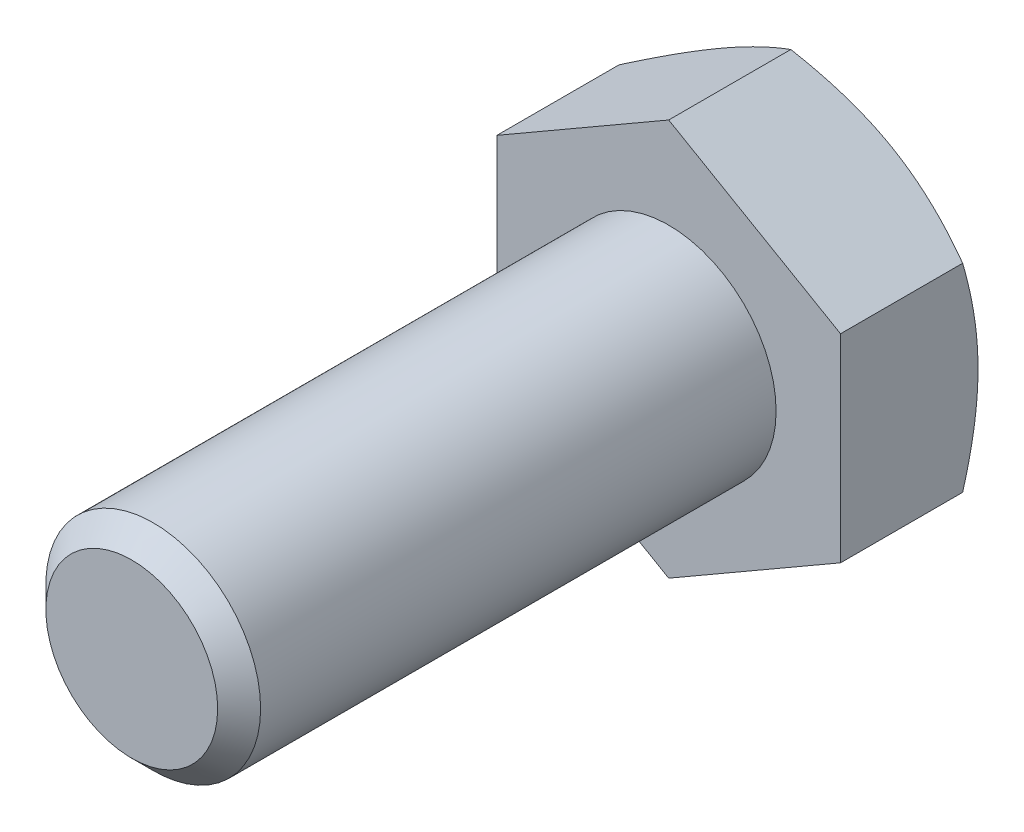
ISO-10303-21;
HEADER;
FILE_DESCRIPTION(('STEP AP214'),'2;1');
FILE_NAME('part.step','',(''),(''),'','','');
FILE_SCHEMA(('AUTOMOTIVE_DESIGN { 1 0 10303 214 1 1 1 1 }'));
ENDSEC;
DATA;
#1=APPLICATION_CONTEXT('core data for automotive mechanical design processes');
#2=APPLICATION_PROTOCOL_DEFINITION('international standard','automotive_design',2000,#1);
#3=PRODUCT_CONTEXT('',#1,'mechanical');
#4=PRODUCT('Part','Part','',(#3));
#5=PRODUCT_RELATED_PRODUCT_CATEGORY('part','',(#4));
#6=PRODUCT_DEFINITION_FORMATION('','',#4);
#7=PRODUCT_DEFINITION_CONTEXT('part definition',#1,'design');
#8=PRODUCT_DEFINITION('design','',#6,#7);
#9=PRODUCT_DEFINITION_SHAPE('','',#8);
#10=(LENGTH_UNIT() NAMED_UNIT(*) SI_UNIT(.MILLI.,.METRE.));
#11=(NAMED_UNIT(*) PLANE_ANGLE_UNIT() SI_UNIT($,.RADIAN.));
#12=(NAMED_UNIT(*) SI_UNIT($,.STERADIAN.) SOLID_ANGLE_UNIT());
#13=UNCERTAINTY_MEASURE_WITH_UNIT(LENGTH_MEASURE(1.E-05),#10,'distance_accuracy_value','');
#14=(GEOMETRIC_REPRESENTATION_CONTEXT(3) GLOBAL_UNCERTAINTY_ASSIGNED_CONTEXT((#13)) GLOBAL_UNIT_ASSIGNED_CONTEXT((#10,
#11,#12)) REPRESENTATION_CONTEXT('',''));
#15=CARTESIAN_POINT('',(0.,0.,0.));
#16=DIRECTION('',(0.,0.,1.));
#17=DIRECTION('',(1.,0.,0.));
#18=AXIS2_PLACEMENT_3D('',#15,#16,#17);
#19=CARTESIAN_POINT('',(0.,0.,25.));
#20=DIRECTION('',(0.,0.,1.));
#21=DIRECTION('',(1.,0.,0.));
#22=AXIS2_PLACEMENT_3D('',#19,#20,#21);
#23=PLANE('',#22);
#24=CARTESIAN_POINT('',(0.,0.,25.));
#25=DIRECTION('',(0.,0.,1.));
#26=DIRECTION('',(1.,0.,0.));
#27=AXIS2_PLACEMENT_3D('',#24,#25,#26);
#28=CIRCLE('',#27,4.);
#29=CARTESIAN_POINT('',(4.00000000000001,0.,25.));
#30=VERTEX_POINT('',#29);
#31=EDGE_CURVE('E205',#30,#30,#28,.T.);
#32=ORIENTED_EDGE('',*,*,#31,.T.);
#33=EDGE_LOOP('',(#32));
#34=FACE_BOUND('',#33,.T.);
#35=ADVANCED_FACE('F31',(#34),#23,.T.);
#36=CARTESIAN_POINT('',(0.,0.,0.));
#37=DIRECTION('',(0.,0.,1.));
#38=DIRECTION('',(1.,0.,0.));
#39=AXIS2_PLACEMENT_3D('',#36,#37,#38);
#40=CYLINDRICAL_SURFACE('',#39,5.);
#41=CARTESIAN_POINT('',(0.,0.,24.));
#42=DIRECTION('',(0.,0.,1.));
#43=DIRECTION('',(1.,0.,0.));
#44=AXIS2_PLACEMENT_3D('',#41,#42,#43);
#45=CIRCLE('',#44,5.);
#46=CARTESIAN_POINT('',(5.,0.,24.));
#47=VERTEX_POINT('',#46);
#48=EDGE_CURVE('E207',#47,#47,#45,.F.);
#49=ORIENTED_EDGE('',*,*,#48,.T.);
#50=EDGE_LOOP('',(#49));
#51=FACE_BOUND('',#50,.T.);
#52=CARTESIAN_POINT('',(0.,0.,0.));
#53=DIRECTION('',(0.,0.,1.));
#54=DIRECTION('',(1.,0.,0.));
#55=AXIS2_PLACEMENT_3D('',#52,#53,#54);
#56=CIRCLE('',#55,5.);
#57=CARTESIAN_POINT('',(5.,0.,0.));
#58=VERTEX_POINT('',#57);
#59=EDGE_CURVE('E208',#58,#58,#56,.F.);
#60=ORIENTED_EDGE('',*,*,#59,.F.);
#61=EDGE_LOOP('',(#60));
#62=FACE_BOUND('',#61,.T.);
#63=ADVANCED_FACE('F196',(#51,#62),#40,.T.);
#64=CARTESIAN_POINT('',(0.,0.,25.));
#65=DIRECTION('',(0.,0.,-1.));
#66=DIRECTION('',(-1.,0.,0.));
#67=AXIS2_PLACEMENT_3D('',#64,#65,#66);
#68=CONICAL_SURFACE('',#67,4.,0.785398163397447);
#69=ORIENTED_EDGE('',*,*,#48,.F.);
#70=EDGE_LOOP('',(#69));
#71=FACE_BOUND('',#70,.T.);
#72=ORIENTED_EDGE('',*,*,#31,.F.);
#73=EDGE_LOOP('',(#72));
#74=FACE_BOUND('',#73,.T.);
#75=ADVANCED_FACE('F201',(#71,#74),#68,.T.);
#76=CARTESIAN_POINT('',(0.,9.23760430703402,-6.4));
#77=DIRECTION('',(0.499999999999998,0.86602540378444,0.));
#78=DIRECTION('',(-0.86602540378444,0.499999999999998,0.));
#79=AXIS2_PLACEMENT_3D('',#76,#77,#78);
#80=PLANE('',#79);
#81=CARTESIAN_POINT('',(-0.000200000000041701,9.23771977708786,-5.68540215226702));
#82=CARTESIAN_POINT('',(0.175648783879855,9.13619343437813,-5.74400928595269));
#83=CARTESIAN_POINT('',(0.352153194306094,9.03428856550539,-5.7999565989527));
#84=CARTESIAN_POINT('',(0.70659546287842,8.82965122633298,-5.90579899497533));
#85=CARTESIAN_POINT('',(0.884533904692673,8.72691841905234,-5.95569146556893));
#86=CARTESIAN_POINT('',(1.42119823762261,8.41707512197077,-6.09530720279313));
#87=CARTESIAN_POINT('',(1.78204258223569,8.20874154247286,-6.17471882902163));
#88=CARTESIAN_POINT('',(2.32203917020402,7.89697436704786,-6.26783835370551));
#89=CARTESIAN_POINT('',(2.49957818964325,7.79447216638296,-6.29436541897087));
#90=CARTESIAN_POINT('',(2.85545911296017,7.58900421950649,-6.33884682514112));
#91=CARTESIAN_POINT('',(3.03380094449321,7.48603851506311,-6.35680192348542));
#92=CARTESIAN_POINT('',(3.39079168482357,7.27992981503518,-6.38368435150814));
#93=CARTESIAN_POINT('',(3.56944001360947,7.17678715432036,-6.39262192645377));
#94=CARTESIAN_POINT('',(3.92690170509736,6.97040655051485,-6.40127769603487));
#95=CARTESIAN_POINT('',(4.10571506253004,6.86716861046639,-6.40099617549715));
#96=CARTESIAN_POINT('',(4.44001336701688,6.67416139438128,-6.39185497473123));
#97=CARTESIAN_POINT('',(4.59552190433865,6.58437849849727,-6.38411039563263));
#98=CARTESIAN_POINT('',(4.90617476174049,6.4050229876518,-6.36179886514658));
#99=CARTESIAN_POINT('',(5.06131905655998,6.31545038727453,-6.34723145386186));
#100=CARTESIAN_POINT('',(5.5261513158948,6.04707935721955,-6.29363930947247));
#101=CARTESIAN_POINT('',(5.83501648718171,5.86875596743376,-6.24473135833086));
#102=CARTESIAN_POINT('',(6.45602322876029,5.51021755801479,-6.12246059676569));
#103=CARTESIAN_POINT('',(6.76808554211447,5.33004829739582,-6.048579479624));
#104=CARTESIAN_POINT('',(7.38755648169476,4.97239658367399,-5.88089985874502));
#105=CARTESIAN_POINT('',(7.69497304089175,4.79490955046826,-5.78714073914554));
#106=CARTESIAN_POINT('',(8.0002,4.61868668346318,-5.68540215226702));
#107=B_SPLINE_CURVE_WITH_KNOTS('',3,(#81,#82,#83,#84,#85,#86,#87,#88,#89,#90,#91,#92,#93,#94,
#95,#96,#97,#98,#99,#100,#101,#102,#103,#104,#105,#106),.UNSPECIFIED.,.F.,.F.,(4,2,2,2,2,2,2,2,
2,2,2,2,4),(0.,0.633973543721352,1.26821965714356,2.53934712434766,3.1593434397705,
3.77928496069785,4.39852133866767,5.01773858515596,5.5568023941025,6.0959025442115,
7.17487077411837,8.27776850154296,9.37850115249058),.UNSPECIFIED.);
#108=CARTESIAN_POINT('',(0.,9.23760430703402,-5.68546882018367));
#109=VERTEX_POINT('',#108);
#110=CARTESIAN_POINT('',(3.99999999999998,6.92820323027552,-6.4));
#111=VERTEX_POINT('',#110);
#112=EDGE_CURVE('E241',#109,#111,#107,.T.);
#113=ORIENTED_EDGE('',*,*,#112,.F.);
#114=DIRECTION('',(0.,0.,1.));
#115=VECTOR('',#114,1.);
#116=CARTESIAN_POINT('',(0.,9.23760430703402,-6.4));
#117=LINE('',#116,#115);
#118=CARTESIAN_POINT('',(0.,9.23760430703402,0.));
#119=VERTEX_POINT('',#118);
#120=EDGE_CURVE('E215',#109,#119,#117,.T.);
#121=ORIENTED_EDGE('',*,*,#120,.T.);
#122=DIRECTION('',(-0.86602540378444,0.499999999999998,0.));
#123=VECTOR('',#122,1.);
#124=CARTESIAN_POINT('',(0.,9.23760430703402,0.));
#125=LINE('',#124,#123);
#126=CARTESIAN_POINT('',(8.,4.61880215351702,0.));
#127=VERTEX_POINT('',#126);
#128=EDGE_CURVE('E239',#127,#119,#125,.T.);
#129=ORIENTED_EDGE('',*,*,#128,.F.);
#130=DIRECTION('',(0.,0.,1.));
#131=VECTOR('',#130,1.);
#132=CARTESIAN_POINT('',(8.,4.61880215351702,-6.4));
#133=LINE('',#132,#131);
#134=CARTESIAN_POINT('',(8.,4.61880215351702,-5.68546882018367));
#135=VERTEX_POINT('',#134);
#136=EDGE_CURVE('E212',#135,#127,#133,.T.);
#137=ORIENTED_EDGE('',*,*,#136,.F.);
#138=EDGE_CURVE('E171',#111,#135,#107,.T.);
#139=ORIENTED_EDGE('',*,*,#138,.F.);
#140=EDGE_LOOP('',(#113,#121,#129,#137,#139));
#141=FACE_BOUND('',#140,.T.);
#142=ADVANCED_FACE('F181',(#141),#80,.T.);
#143=CARTESIAN_POINT('',(8.,-4.61880215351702,-6.4));
#144=DIRECTION('',(1.,0.,0.));
#145=DIRECTION('',(0.,0.,-1.));
#146=AXIS2_PLACEMENT_3D('',#143,#144,#145);
#147=PLANE('',#146);
#148=CARTESIAN_POINT('',(8.,-12.5978512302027,-2.40281206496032));
#149=CARTESIAN_POINT('',(8.,-12.246746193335,-2.57388946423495));
#150=CARTESIAN_POINT('',(8.,-11.8948553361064,-2.74338074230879));
#151=CARTESIAN_POINT('',(8.,-11.1890846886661,-3.07830251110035));
#152=CARTESIAN_POINT('',(8.,-10.835204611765,-3.24373239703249));
#153=CARTESIAN_POINT('',(8.,-10.1233054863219,-3.57043443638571));
#154=CARTESIAN_POINT('',(8.,-9.76527449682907,-3.73168065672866));
#155=CARTESIAN_POINT('',(8.,-9.04643054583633,-4.04782365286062));
#156=CARTESIAN_POINT('',(8.,-8.68561771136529,-4.20272071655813));
#157=CARTESIAN_POINT('',(8.,-7.94836823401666,-4.50960168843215));
#158=CARTESIAN_POINT('',(8.,-7.57181608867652,-4.66130959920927));
#159=CARTESIAN_POINT('',(8.,-6.81437869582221,-4.95369969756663));
#160=CARTESIAN_POINT('',(8.,-6.43349297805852,-5.09438067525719));
#161=CARTESIAN_POINT('',(8.,-5.66743059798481,-5.36116349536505));
#162=CARTESIAN_POINT('',(8.,-5.28226375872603,-5.48729325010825));
#163=CARTESIAN_POINT('',(8.,-4.50642197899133,-5.72105487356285));
#164=CARTESIAN_POINT('',(8.,-4.11574875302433,-5.82869236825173));
#165=CARTESIAN_POINT('',(8.,-3.33076858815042,-6.01985550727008));
#166=CARTESIAN_POINT('',(8.,-2.9364953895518,-6.10351603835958));
#167=CARTESIAN_POINT('',(8.,-2.34134760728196,-6.20749259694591));
#168=CARTESIAN_POINT('',(8.,-2.1423290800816,-6.23856705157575));
#169=CARTESIAN_POINT('',(8.,-1.7432391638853,-6.29294025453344));
#170=CARTESIAN_POINT('',(8.,-1.54316787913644,-6.31623975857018));
#171=CARTESIAN_POINT('',(8.,-1.14493807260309,-6.35429623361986));
#172=CARTESIAN_POINT('',(8.,-0.94679021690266,-6.36916434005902));
#173=CARTESIAN_POINT('',(8.,-0.550042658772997,-6.39050002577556));
#174=CARTESIAN_POINT('',(8.,-0.351442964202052,-6.39696775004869));
#175=CARTESIAN_POINT('',(8.,0.0458536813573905,-6.40134753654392));
#176=CARTESIAN_POINT('',(8.,0.244550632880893,-6.39925955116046));
#177=CARTESIAN_POINT('',(8.,0.641675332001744,-6.38658102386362));
#178=CARTESIAN_POINT('',(8.,0.840103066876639,-6.37599009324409));
#179=CARTESIAN_POINT('',(8.,1.31123186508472,-6.3409781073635));
#180=CARTESIAN_POINT('',(8.,1.58366327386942,-6.31284309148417));
#181=CARTESIAN_POINT('',(8.,2.12661564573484,-6.24203710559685));
#182=CARTESIAN_POINT('',(8.,2.39713636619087,-6.19936432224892));
#183=CARTESIAN_POINT('',(8.,3.20545284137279,-6.0517930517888));
#184=CARTESIAN_POINT('',(8.,3.73973646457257,-5.9273641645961));
#185=CARTESIAN_POINT('',(8.,4.53906436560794,-5.71012995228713));
#186=CARTESIAN_POINT('',(8.,4.80821183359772,-5.63154182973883));
#187=CARTESIAN_POINT('',(8.,5.34389592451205,-5.46584170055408));
#188=CARTESIAN_POINT('',(8.,5.61043252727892,-5.37872962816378));
#189=CARTESIAN_POINT('',(8.,6.14097486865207,-5.1974091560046));
#190=CARTESIAN_POINT('',(8.,6.40498129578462,-5.10320275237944));
#191=CARTESIAN_POINT('',(8.,6.93077992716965,-4.90883812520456));
#192=CARTESIAN_POINT('',(8.,7.19257218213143,-4.8086800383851));
#193=CARTESIAN_POINT('',(8.,7.89757234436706,-4.53123135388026));
#194=CARTESIAN_POINT('',(8.,8.33892089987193,-4.34922056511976));
#195=CARTESIAN_POINT('',(8.,9.21706508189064,-3.97449001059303));
#196=CARTESIAN_POINT('',(8.,9.6538601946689,-3.78176905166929));
#197=CARTESIAN_POINT('',(8.,10.5239434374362,-3.38815487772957));
#198=CARTESIAN_POINT('',(8.,10.9572301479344,-3.18725853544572));
#199=CARTESIAN_POINT('',(8.,11.8208356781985,-2.77925077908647));
#200=CARTESIAN_POINT('',(8.,12.251154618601,-2.57213961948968));
#201=CARTESIAN_POINT('',(8.,13.1101061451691,-2.15271844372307));
#202=CARTESIAN_POINT('',(8.,13.5387348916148,-1.94040058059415));
#203=CARTESIAN_POINT('',(8.,14.3940561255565,-1.51189757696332));
#204=CARTESIAN_POINT('',(8.,14.8207485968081,-1.29571240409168));
#205=CARTESIAN_POINT('',(8.,15.672448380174,-0.860283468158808));
#206=CARTESIAN_POINT('',(8.,16.0974560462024,-0.641040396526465));
#207=CARTESIAN_POINT('',(8.,16.9461557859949,-0.200021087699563));
#208=CARTESIAN_POINT('',(8.,17.3698478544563,0.0217551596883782));
#209=CARTESIAN_POINT('',(8.,18.5495919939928,0.64296873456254));
#210=CARTESIAN_POINT('',(8.,19.3044430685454,1.04468640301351));
#211=CARTESIAN_POINT('',(8.,20.8116128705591,1.85294502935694));
#212=CARTESIAN_POINT('',(8.,21.5639314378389,2.25948628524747));
#213=CARTESIAN_POINT('',(8.,23.0640825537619,3.074790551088));
#214=CARTESIAN_POINT('',(8.,23.8119216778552,3.48354147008));
#215=CARTESIAN_POINT('',(8.,24.9325210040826,4.09870759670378));
#216=CARTESIAN_POINT('',(8.,25.3058462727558,4.30409483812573));
#217=CARTESIAN_POINT('',(8.,26.0521604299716,4.71547851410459));
#218=CARTESIAN_POINT('',(8.,26.4251493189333,4.92147494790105));
#219=CARTESIAN_POINT('',(8.,26.7979906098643,5.12773824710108));
#220=B_SPLINE_CURVE_WITH_KNOTS('',3,(#148,#149,#150,#151,#152,#153,#154,#155,#156,#157,#158,
#159,#160,#161,#162,#163,#164,#165,#166,#167,#168,#169,#170,#171,#172,#173,#174,#175,#176,#177,
#178,#179,#180,#181,#182,#183,#184,#185,#186,#187,#188,#189,#190,#191,#192,#193,#194,#195,#196,
#197,#198,#199,#200,#201,#202,#203,#204,#205,#206,#207,#208,#209,#210,#211,#212,#213,#214,#215,
#216,#217,#218,#219),.UNSPECIFIED.,.F.,.F.,(4,2,2,2,2,2,2,2,2,2,2,2,2,2,2,2,2,2,2,2,2,2,2,2,2,2,
2,2,2,2,2,2,2,2,2,4),(0.,1.17171303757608,2.34359951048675,3.52154779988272,4.69944261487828,
5.91720060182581,7.13509201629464,8.35060698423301,9.56575149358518,10.7739194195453,
11.3780811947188,11.982184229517,12.5781274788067,13.1740604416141,13.7699967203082,
14.3659602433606,15.1871414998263,16.0084252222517,17.651791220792,18.4928743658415,
19.3339639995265,20.1748178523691,21.0156523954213,22.4476587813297,23.8798250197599,
25.312544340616,26.7452050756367,28.1801767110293,29.6151603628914,31.0498246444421,
32.48449470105,35.0497345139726,37.6151336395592,40.1718943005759,41.4501744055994,
42.7284529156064),.UNSPECIFIED.);
#221=CARTESIAN_POINT('',(8.,0.,-6.4));
#222=VERTEX_POINT('',#221);
#223=EDGE_CURVE('E169',#135,#222,#220,.F.);
#224=ORIENTED_EDGE('',*,*,#223,.F.);
#225=ORIENTED_EDGE('',*,*,#136,.T.);
#226=DIRECTION('',(0.,1.,0.));
#227=VECTOR('',#226,1.);
#228=CARTESIAN_POINT('',(8.,-4.61880215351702,0.));
#229=LINE('',#228,#227);
#230=CARTESIAN_POINT('',(8.,-4.61880215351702,0.));
#231=VERTEX_POINT('',#230);
#232=EDGE_CURVE('E217',#231,#127,#229,.T.);
#233=ORIENTED_EDGE('',*,*,#232,.F.);
#234=DIRECTION('',(0.,0.,1.));
#235=VECTOR('',#234,1.);
#236=CARTESIAN_POINT('',(8.,-4.61880215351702,-6.4));
#237=LINE('',#236,#235);
#238=CARTESIAN_POINT('',(8.,-4.61880215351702,-5.68546882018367));
#239=VERTEX_POINT('',#238);
#240=EDGE_CURVE('E223',#239,#231,#237,.T.);
#241=ORIENTED_EDGE('',*,*,#240,.F.);
#242=EDGE_CURVE('E164',#222,#239,#220,.F.);
#243=ORIENTED_EDGE('',*,*,#242,.F.);
#244=EDGE_LOOP('',(#224,#225,#233,#241,#243));
#245=FACE_BOUND('',#244,.T.);
#246=ADVANCED_FACE('F177',(#245),#147,.T.);
#247=CARTESIAN_POINT('',(0.,-9.23760430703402,-6.4));
#248=DIRECTION('',(0.499999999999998,-0.86602540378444,0.));
#249=DIRECTION('',(0.86602540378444,0.499999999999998,0.));
#250=AXIS2_PLACEMENT_3D('',#247,#248,#249);
#251=PLANE('',#250);
#252=CARTESIAN_POINT('',(8.0002,-4.61868668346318,-5.68540215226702));
#253=CARTESIAN_POINT('',(7.8243512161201,-4.72021302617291,-5.74400928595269));
#254=CARTESIAN_POINT('',(7.64784680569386,-4.82211789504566,-5.7999565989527));
#255=CARTESIAN_POINT('',(7.29340453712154,-5.02675523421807,-5.90579899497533));
#256=CARTESIAN_POINT('',(7.11546609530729,-5.12948804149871,-5.95569146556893));
#257=CARTESIAN_POINT('',(6.57880176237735,-5.43933133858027,-6.09530720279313));
#258=CARTESIAN_POINT('',(6.21795741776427,-5.64766491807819,-6.17471882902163));
#259=CARTESIAN_POINT('',(5.67796082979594,-5.95943209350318,-6.26783835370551));
#260=CARTESIAN_POINT('',(5.50042181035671,-6.06193429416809,-6.29436541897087));
#261=CARTESIAN_POINT('',(5.14454088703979,-6.26740224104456,-6.33884682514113));
#262=CARTESIAN_POINT('',(4.96619905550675,-6.37036794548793,-6.35680192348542));
#263=CARTESIAN_POINT('',(4.60920831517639,-6.57647664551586,-6.38368435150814));
#264=CARTESIAN_POINT('',(4.43055998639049,-6.67961930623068,-6.39262192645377));
#265=CARTESIAN_POINT('',(4.0730982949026,-6.88599991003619,-6.40127769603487));
#266=CARTESIAN_POINT('',(3.89428493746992,-6.98923785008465,-6.40099617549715));
#267=CARTESIAN_POINT('',(3.55998663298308,-7.18224506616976,-6.39185497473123));
#268=CARTESIAN_POINT('',(3.40447809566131,-7.27202796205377,-6.38411039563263));
#269=CARTESIAN_POINT('',(3.09382523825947,-7.45138347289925,-6.36179886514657));
#270=CARTESIAN_POINT('',(2.93868094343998,-7.54095607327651,-6.34723145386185));
#271=CARTESIAN_POINT('',(2.47384868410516,-7.80932710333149,-6.29363930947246));
#272=CARTESIAN_POINT('',(2.16498351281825,-7.98765049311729,-6.24473135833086));
#273=CARTESIAN_POINT('',(1.54397677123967,-8.34618890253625,-6.12246059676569));
#274=CARTESIAN_POINT('',(1.23191445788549,-8.52635816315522,-6.048579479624));
#275=CARTESIAN_POINT('',(0.612443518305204,-8.88400987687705,-5.88089985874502));
#276=CARTESIAN_POINT('',(0.30502695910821,-9.06149691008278,-5.78714073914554));
#277=CARTESIAN_POINT('',(-0.000200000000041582,-9.23771977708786,-5.68540215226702));
#278=B_SPLINE_CURVE_WITH_KNOTS('',3,(#252,#253,#254,#255,#256,#257,#258,#259,#260,#261,#262,
#263,#264,#265,#266,#267,#268,#269,#270,#271,#272,#273,#274,#275,#276,#277),.UNSPECIFIED.,.F.,
.F.,(4,2,2,2,2,2,2,2,2,2,2,2,4),(0.,0.633973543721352,1.26821965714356,2.53934712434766,
3.1593434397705,3.77928496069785,4.39852133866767,5.01773858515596,5.5568023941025,
6.09590254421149,7.17487077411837,8.27776850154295,9.37850115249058),.UNSPECIFIED.);
#279=CARTESIAN_POINT('',(3.99999999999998,-6.92820323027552,-6.4));
#280=VERTEX_POINT('',#279);
#281=EDGE_CURVE('E170',#239,#280,#278,.T.);
#282=ORIENTED_EDGE('',*,*,#281,.F.);
#283=ORIENTED_EDGE('',*,*,#240,.T.);
#284=DIRECTION('',(0.86602540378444,0.499999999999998,0.));
#285=VECTOR('',#284,1.);
#286=CARTESIAN_POINT('',(0.,-9.23760430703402,0.));
#287=LINE('',#286,#285);
#288=CARTESIAN_POINT('',(0.,-9.23760430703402,0.));
#289=VERTEX_POINT('',#288);
#290=EDGE_CURVE('E228',#289,#231,#287,.T.);
#291=ORIENTED_EDGE('',*,*,#290,.F.);
#292=DIRECTION('',(0.,0.,1.));
#293=VECTOR('',#292,1.);
#294=CARTESIAN_POINT('',(0.,-9.23760430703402,-6.4));
#295=LINE('',#294,#293);
#296=CARTESIAN_POINT('',(0.,-9.23760430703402,-5.68546882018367));
#297=VERTEX_POINT('',#296);
#298=EDGE_CURVE('E221',#297,#289,#295,.T.);
#299=ORIENTED_EDGE('',*,*,#298,.F.);
#300=EDGE_CURVE('E158',#280,#297,#278,.T.);
#301=ORIENTED_EDGE('',*,*,#300,.F.);
#302=EDGE_LOOP('',(#282,#283,#291,#299,#301));
#303=FACE_BOUND('',#302,.T.);
#304=ADVANCED_FACE('F180',(#303),#251,.T.);
#305=CARTESIAN_POINT('',(0.,-9.23760430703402,-6.4));
#306=DIRECTION('',(-0.500000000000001,-0.866025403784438,0.));
#307=DIRECTION('',(0.866025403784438,-0.500000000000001,0.));
#308=AXIS2_PLACEMENT_3D('',#305,#306,#307);
#309=PLANE('',#308);
#310=CARTESIAN_POINT('',(0.000199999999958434,-9.23771977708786,-5.68540215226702));
#311=CARTESIAN_POINT('',(-0.175648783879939,-9.13619343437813,-5.74400928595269));
#312=CARTESIAN_POINT('',(-0.352153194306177,-9.03428856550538,-5.7999565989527));
#313=CARTESIAN_POINT('',(-0.706595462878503,-8.82965122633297,-5.90579899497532));
#314=CARTESIAN_POINT('',(-0.884533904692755,-8.72691841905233,-5.95569146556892));
#315=CARTESIAN_POINT('',(-1.42119823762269,-8.41707512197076,-6.09530720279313));
#316=CARTESIAN_POINT('',(-1.78204258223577,-8.20874154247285,-6.17471882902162));
#317=CARTESIAN_POINT('',(-2.3220391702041,-7.89697436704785,-6.2678383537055));
#318=CARTESIAN_POINT('',(-2.49957818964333,-7.79447216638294,-6.29436541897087));
#319=CARTESIAN_POINT('',(-2.85545911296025,-7.58900421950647,-6.33884682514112));
#320=CARTESIAN_POINT('',(-3.03380094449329,-7.4860385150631,-6.35680192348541));
#321=CARTESIAN_POINT('',(-3.39079168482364,-7.27992981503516,-6.38368435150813));
#322=CARTESIAN_POINT('',(-3.56944001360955,-7.17678715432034,-6.39262192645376));
#323=CARTESIAN_POINT('',(-3.92690170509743,-6.97040655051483,-6.40127769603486));
#324=CARTESIAN_POINT('',(-4.10571506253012,-6.86716861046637,-6.40099617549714));
#325=CARTESIAN_POINT('',(-4.44001336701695,-6.67416139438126,-6.39185497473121));
#326=CARTESIAN_POINT('',(-4.59552190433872,-6.58437849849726,-6.38411039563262));
#327=CARTESIAN_POINT('',(-4.90617476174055,-6.40502298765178,-6.36179886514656));
#328=CARTESIAN_POINT('',(-5.06131905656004,-6.31545038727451,-6.34723145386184));
#329=CARTESIAN_POINT('',(-5.52615131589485,-6.04707935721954,-6.29363930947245));
#330=CARTESIAN_POINT('',(-5.83501648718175,-5.86875596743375,-6.24473135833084));
#331=CARTESIAN_POINT('',(-6.45602322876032,-5.51021755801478,-6.12246059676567));
#332=CARTESIAN_POINT('',(-6.7680855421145,-5.33004829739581,-6.04857947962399));
#333=CARTESIAN_POINT('',(-7.38755648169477,-4.97239658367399,-5.88089985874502));
#334=CARTESIAN_POINT('',(-7.69497304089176,-4.79490955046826,-5.78714073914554));
#335=CARTESIAN_POINT('',(-8.0002,-4.61868668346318,-5.68540215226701));
#336=B_SPLINE_CURVE_WITH_KNOTS('',3,(#310,#311,#312,#313,#314,#315,#316,#317,#318,#319,#320,
#321,#322,#323,#324,#325,#326,#327,#328,#329,#330,#331,#332,#333,#334,#335),.UNSPECIFIED.,.F.,
.F.,(4,2,2,2,2,2,2,2,2,2,2,2,4),(0.,0.633973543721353,1.26821965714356,2.53934712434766,
3.1593434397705,3.77928496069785,4.39852133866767,5.01773858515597,5.55680239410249,
6.09590254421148,7.17487077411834,8.2777685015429,9.37850115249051),.UNSPECIFIED.);
#337=CARTESIAN_POINT('',(-4.00000000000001,-6.9282032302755,-6.4));
#338=VERTEX_POINT('',#337);
#339=EDGE_CURVE('E260',#297,#338,#336,.T.);
#340=ORIENTED_EDGE('',*,*,#339,.F.);
#341=ORIENTED_EDGE('',*,*,#298,.T.);
#342=DIRECTION('',(0.866025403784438,-0.500000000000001,0.));
#343=VECTOR('',#342,1.);
#344=CARTESIAN_POINT('',(0.,-9.23760430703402,0.));
#345=LINE('',#344,#343);
#346=CARTESIAN_POINT('',(-8.,-4.61880215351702,0.));
#347=VERTEX_POINT('',#346);
#348=EDGE_CURVE('E231',#347,#289,#345,.T.);
#349=ORIENTED_EDGE('',*,*,#348,.F.);
#350=DIRECTION('',(0.,0.,1.));
#351=VECTOR('',#350,1.);
#352=CARTESIAN_POINT('',(-8.,-4.61880215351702,-6.4));
#353=LINE('',#352,#351);
#354=CARTESIAN_POINT('',(-8.,-4.61880215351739,-5.68546882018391));
#355=VERTEX_POINT('',#354);
#356=EDGE_CURVE('E219',#355,#347,#353,.T.);
#357=ORIENTED_EDGE('',*,*,#356,.F.);
#358=EDGE_CURVE('E107',#338,#355,#336,.T.);
#359=ORIENTED_EDGE('',*,*,#358,.F.);
#360=EDGE_LOOP('',(#340,#341,#349,#357,#359));
#361=FACE_BOUND('',#360,.T.);
#362=ADVANCED_FACE('F185',(#361),#309,.T.);
#363=CARTESIAN_POINT('',(-8.,-4.61880215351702,-6.4));
#364=DIRECTION('',(-1.,0.,0.));
#365=DIRECTION('',(0.,0.,1.));
#366=AXIS2_PLACEMENT_3D('',#363,#364,#365);
#367=PLANE('',#366);
#368=CARTESIAN_POINT('',(-8.,-12.5978512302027,-2.40281206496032));
#369=CARTESIAN_POINT('',(-8.,-12.246746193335,-2.57388946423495));
#370=CARTESIAN_POINT('',(-8.,-11.8948553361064,-2.74338074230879));
#371=CARTESIAN_POINT('',(-8.,-11.1890846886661,-3.07830251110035));
#372=CARTESIAN_POINT('',(-8.,-10.835204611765,-3.24373239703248));
#373=CARTESIAN_POINT('',(-8.,-10.1233054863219,-3.57043443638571));
#374=CARTESIAN_POINT('',(-8.,-9.76527449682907,-3.73168065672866));
#375=CARTESIAN_POINT('',(-8.,-9.04643054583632,-4.04782365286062));
#376=CARTESIAN_POINT('',(-8.,-8.68561771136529,-4.20272071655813));
#377=CARTESIAN_POINT('',(-8.,-7.94836823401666,-4.50960168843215));
#378=CARTESIAN_POINT('',(-8.,-7.57181608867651,-4.66130959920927));
#379=CARTESIAN_POINT('',(-8.,-6.8143786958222,-4.95369969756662));
#380=CARTESIAN_POINT('',(-8.,-6.43349297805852,-5.09438067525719));
#381=CARTESIAN_POINT('',(-8.,-5.66743059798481,-5.36116349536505));
#382=CARTESIAN_POINT('',(-8.,-5.28226375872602,-5.48729325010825));
#383=CARTESIAN_POINT('',(-8.,-4.50642197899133,-5.72105487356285));
#384=CARTESIAN_POINT('',(-8.,-4.11574875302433,-5.82869236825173));
#385=CARTESIAN_POINT('',(-8.,-3.33076858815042,-6.01985550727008));
#386=CARTESIAN_POINT('',(-8.,-2.9364953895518,-6.10351603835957));
#387=CARTESIAN_POINT('',(-8.,-2.34134760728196,-6.20749259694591));
#388=CARTESIAN_POINT('',(-8.,-2.1423290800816,-6.23856705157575));
#389=CARTESIAN_POINT('',(-8.,-1.7432391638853,-6.29294025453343));
#390=CARTESIAN_POINT('',(-8.,-1.54316787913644,-6.31623975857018));
#391=CARTESIAN_POINT('',(-8.,-1.14493807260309,-6.35429623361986));
#392=CARTESIAN_POINT('',(-8.,-0.946790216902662,-6.36916434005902));
#393=CARTESIAN_POINT('',(-8.,-0.550042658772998,-6.39050002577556));
#394=CARTESIAN_POINT('',(-8.,-0.351442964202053,-6.39696775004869));
#395=CARTESIAN_POINT('',(-8.,0.0458536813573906,-6.40134753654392));
#396=CARTESIAN_POINT('',(-8.,0.244550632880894,-6.39925955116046));
#397=CARTESIAN_POINT('',(-8.,0.641675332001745,-6.38658102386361));
#398=CARTESIAN_POINT('',(-8.,0.84010306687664,-6.37599009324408));
#399=CARTESIAN_POINT('',(-8.,1.31123186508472,-6.3409781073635));
#400=CARTESIAN_POINT('',(-8.,1.58366327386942,-6.31284309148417));
#401=CARTESIAN_POINT('',(-8.,2.12661564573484,-6.24203710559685));
#402=CARTESIAN_POINT('',(-8.,2.39713636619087,-6.19936432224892));
#403=CARTESIAN_POINT('',(-8.,3.20545284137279,-6.0517930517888));
#404=CARTESIAN_POINT('',(-8.,3.73973646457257,-5.92736416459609));
#405=CARTESIAN_POINT('',(-8.,4.53906436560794,-5.71012995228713));
#406=CARTESIAN_POINT('',(-8.,4.80821183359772,-5.63154182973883));
#407=CARTESIAN_POINT('',(-8.,5.34389592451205,-5.46584170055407));
#408=CARTESIAN_POINT('',(-8.,5.61043252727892,-5.37872962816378));
#409=CARTESIAN_POINT('',(-8.,6.14097486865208,-5.1974091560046));
#410=CARTESIAN_POINT('',(-8.,6.40498129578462,-5.10320275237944));
#411=CARTESIAN_POINT('',(-8.,6.93077992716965,-4.90883812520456));
#412=CARTESIAN_POINT('',(-8.,7.19257218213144,-4.8086800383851));
#413=CARTESIAN_POINT('',(-8.,7.89757234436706,-4.53123135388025));
#414=CARTESIAN_POINT('',(-8.,8.33892089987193,-4.34922056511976));
#415=CARTESIAN_POINT('',(-8.,9.21706508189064,-3.97449001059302));
#416=CARTESIAN_POINT('',(-8.,9.6538601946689,-3.78176905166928));
#417=CARTESIAN_POINT('',(-8.,10.5239434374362,-3.38815487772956));
#418=CARTESIAN_POINT('',(-8.,10.9572301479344,-3.18725853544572));
#419=CARTESIAN_POINT('',(-8.,11.8208356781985,-2.77925077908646));
#420=CARTESIAN_POINT('',(-8.,12.251154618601,-2.57213961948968));
#421=CARTESIAN_POINT('',(-8.,13.1101061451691,-2.15271844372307));
#422=CARTESIAN_POINT('',(-8.,13.5387348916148,-1.94040058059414));
#423=CARTESIAN_POINT('',(-8.,14.3940561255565,-1.51189757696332));
#424=CARTESIAN_POINT('',(-8.,14.8207485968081,-1.29571240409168));
#425=CARTESIAN_POINT('',(-8.,15.672448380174,-0.860283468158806));
#426=CARTESIAN_POINT('',(-8.,16.0974560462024,-0.641040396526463));
#427=CARTESIAN_POINT('',(-8.,16.9461557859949,-0.200021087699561));
#428=CARTESIAN_POINT('',(-8.,17.3698478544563,0.0217551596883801));
#429=CARTESIAN_POINT('',(-8.,18.5495919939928,0.642968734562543));
#430=CARTESIAN_POINT('',(-8.,19.3044430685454,1.04468640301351));
#431=CARTESIAN_POINT('',(-8.,20.8116128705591,1.85294502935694));
#432=CARTESIAN_POINT('',(-8.,21.5639314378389,2.25948628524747));
#433=CARTESIAN_POINT('',(-8.,23.0640825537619,3.07479055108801));
#434=CARTESIAN_POINT('',(-8.,23.8119216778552,3.48354147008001));
#435=CARTESIAN_POINT('',(-8.,24.9325210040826,4.09870759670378));
#436=CARTESIAN_POINT('',(-8.,25.3058462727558,4.30409483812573));
#437=CARTESIAN_POINT('',(-8.,26.0521604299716,4.71547851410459));
#438=CARTESIAN_POINT('',(-8.,26.4251493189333,4.92147494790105));
#439=CARTESIAN_POINT('',(-8.,26.7979906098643,5.12773824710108));
#440=B_SPLINE_CURVE_WITH_KNOTS('',3,(#368,#369,#370,#371,#372,#373,#374,#375,#376,#377,#378,
#379,#380,#381,#382,#383,#384,#385,#386,#387,#388,#389,#390,#391,#392,#393,#394,#395,#396,#397,
#398,#399,#400,#401,#402,#403,#404,#405,#406,#407,#408,#409,#410,#411,#412,#413,#414,#415,#416,
#417,#418,#419,#420,#421,#422,#423,#424,#425,#426,#427,#428,#429,#430,#431,#432,#433,#434,#435,
#436,#437,#438,#439),.UNSPECIFIED.,.F.,.F.,(4,2,2,2,2,2,2,2,2,2,2,2,2,2,2,2,2,2,2,2,2,2,2,2,2,2,
2,2,2,2,2,2,2,2,2,4),(0.,1.17171303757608,2.34359951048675,3.52154779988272,4.69944261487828,
5.91720060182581,7.13509201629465,8.35060698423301,9.56575149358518,10.7739194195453,
11.3780811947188,11.982184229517,12.5781274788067,13.1740604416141,13.7699967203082,
14.3659602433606,15.1871414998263,16.0084252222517,17.651791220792,18.4928743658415,
19.3339639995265,20.1748178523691,21.0156523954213,22.4476587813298,23.8798250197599,
25.312544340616,26.7452050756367,28.1801767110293,29.6151603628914,31.0498246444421,
32.48449470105,35.0497345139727,37.6151336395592,40.1718943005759,41.4501744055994,
42.7284529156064),.UNSPECIFIED.);
#441=CARTESIAN_POINT('',(-8.,0.,-6.4));
#442=VERTEX_POINT('',#441);
#443=EDGE_CURVE('E102',#355,#442,#440,.T.);
#444=ORIENTED_EDGE('',*,*,#443,.F.);
#445=ORIENTED_EDGE('',*,*,#356,.T.);
#446=DIRECTION('',(0.,-1.,0.));
#447=VECTOR('',#446,1.);
#448=CARTESIAN_POINT('',(-8.,-4.61880215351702,0.));
#449=LINE('',#448,#447);
#450=CARTESIAN_POINT('',(-8.,4.61880215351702,0.));
#451=VERTEX_POINT('',#450);
#452=EDGE_CURVE('E234',#451,#347,#449,.T.);
#453=ORIENTED_EDGE('',*,*,#452,.F.);
#454=DIRECTION('',(0.,0.,1.));
#455=VECTOR('',#454,1.);
#456=CARTESIAN_POINT('',(-8.,4.61880215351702,-6.4));
#457=LINE('',#456,#455);
#458=CARTESIAN_POINT('',(-8.,4.61880215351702,-5.68546882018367));
#459=VERTEX_POINT('',#458);
#460=EDGE_CURVE('E128',#459,#451,#457,.T.);
#461=ORIENTED_EDGE('',*,*,#460,.F.);
#462=EDGE_CURVE('E111',#442,#459,#440,.T.);
#463=ORIENTED_EDGE('',*,*,#462,.F.);
#464=EDGE_LOOP('',(#444,#445,#453,#461,#463));
#465=FACE_BOUND('',#464,.T.);
#466=ADVANCED_FACE('F126',(#465),#367,.T.);
#467=CARTESIAN_POINT('',(-8.,4.61880215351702,-6.4));
#468=DIRECTION('',(-0.500000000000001,0.866025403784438,0.));
#469=DIRECTION('',(-0.866025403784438,-0.500000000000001,0.));
#470=AXIS2_PLACEMENT_3D('',#467,#468,#469);
#471=PLANE('',#470);
#472=CARTESIAN_POINT('',(-8.0002,4.61868668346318,-5.68540215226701));
#473=CARTESIAN_POINT('',(-7.8243512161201,4.72021302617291,-5.74400928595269));
#474=CARTESIAN_POINT('',(-7.64784680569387,4.82211789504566,-5.7999565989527));
#475=CARTESIAN_POINT('',(-7.29340453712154,5.02675523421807,-5.90579899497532));
#476=CARTESIAN_POINT('',(-7.11546609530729,5.12948804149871,-5.95569146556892));
#477=CARTESIAN_POINT('',(-6.57880176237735,5.43933133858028,-6.09530720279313));
#478=CARTESIAN_POINT('',(-6.21795741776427,5.6476649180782,-6.17471882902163));
#479=CARTESIAN_POINT('',(-5.67796082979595,5.95943209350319,-6.2678383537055));
#480=CARTESIAN_POINT('',(-5.50042181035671,6.0619342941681,-6.29436541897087));
#481=CARTESIAN_POINT('',(-5.1445408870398,6.26740224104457,-6.33884682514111));
#482=CARTESIAN_POINT('',(-4.96619905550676,6.37036794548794,-6.35680192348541));
#483=CARTESIAN_POINT('',(-4.6092083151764,6.57647664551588,-6.38368435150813));
#484=CARTESIAN_POINT('',(-4.43055998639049,6.6796193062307,-6.39262192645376));
#485=CARTESIAN_POINT('',(-4.07309829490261,6.88599991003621,-6.40127769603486));
#486=CARTESIAN_POINT('',(-3.89428493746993,6.98923785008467,-6.40099617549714));
#487=CARTESIAN_POINT('',(-3.55998663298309,7.18224506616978,-6.39185497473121));
#488=CARTESIAN_POINT('',(-3.40447809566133,7.27202796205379,-6.38411039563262));
#489=CARTESIAN_POINT('',(-3.09382523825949,7.45138347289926,-6.36179886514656));
#490=CARTESIAN_POINT('',(-2.93868094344,7.54095607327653,-6.34723145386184));
#491=CARTESIAN_POINT('',(-2.47384868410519,7.80932710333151,-6.29363930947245));
#492=CARTESIAN_POINT('',(-2.16498351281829,7.9876504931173,-6.24473135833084));
#493=CARTESIAN_POINT('',(-1.54397677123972,8.34618890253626,-6.12246059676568));
#494=CARTESIAN_POINT('',(-1.23191445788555,8.52635816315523,-6.04857947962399));
#495=CARTESIAN_POINT('',(-0.612443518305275,8.88400987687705,-5.88089985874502));
#496=CARTESIAN_POINT('',(-0.305026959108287,9.06149691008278,-5.78714073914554));
#497=CARTESIAN_POINT('',(0.000199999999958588,9.23771977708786,-5.68540215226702));
#498=B_SPLINE_CURVE_WITH_KNOTS('',3,(#472,#473,#474,#475,#476,#477,#478,#479,#480,#481,#482,
#483,#484,#485,#486,#487,#488,#489,#490,#491,#492,#493,#494,#495,#496,#497),.UNSPECIFIED.,.F.,
.F.,(4,2,2,2,2,2,2,2,2,2,2,2,4),(0.,0.633973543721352,1.26821965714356,2.53934712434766,
3.1593434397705,3.77928496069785,4.39852133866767,5.01773858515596,5.55680239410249,
6.09590254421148,7.17487077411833,8.2777685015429,9.37850115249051),.UNSPECIFIED.);
#499=CARTESIAN_POINT('',(-4.00000000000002,6.92820323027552,-6.4));
#500=VERTEX_POINT('',#499);
#501=EDGE_CURVE('E117',#459,#500,#498,.T.);
#502=ORIENTED_EDGE('',*,*,#501,.F.);
#503=ORIENTED_EDGE('',*,*,#460,.T.);
#504=DIRECTION('',(-0.866025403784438,-0.500000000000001,0.));
#505=VECTOR('',#504,1.);
#506=CARTESIAN_POINT('',(-8.,4.61880215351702,0.));
#507=LINE('',#506,#505);
#508=EDGE_CURVE('E237',#119,#451,#507,.T.);
#509=ORIENTED_EDGE('',*,*,#508,.F.);
#510=ORIENTED_EDGE('',*,*,#120,.F.);
#511=EDGE_CURVE('E119',#500,#109,#498,.T.);
#512=ORIENTED_EDGE('',*,*,#511,.F.);
#513=EDGE_LOOP('',(#502,#503,#509,#510,#512));
#514=FACE_BOUND('',#513,.T.);
#515=ADVANCED_FACE('F193',(#514),#471,.T.);
#516=CARTESIAN_POINT('',(8.,4.61880215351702,0.));
#517=DIRECTION('',(0.,0.,1.));
#518=DIRECTION('',(1.,0.,0.));
#519=AXIS2_PLACEMENT_3D('',#516,#517,#518);
#520=PLANE('',#519);
#521=ORIENTED_EDGE('',*,*,#59,.T.);
#522=EDGE_LOOP('',(#521));
#523=FACE_BOUND('',#522,.T.);
#524=ORIENTED_EDGE('',*,*,#128,.T.);
#525=ORIENTED_EDGE('',*,*,#508,.T.);
#526=ORIENTED_EDGE('',*,*,#452,.T.);
#527=ORIENTED_EDGE('',*,*,#348,.T.);
#528=ORIENTED_EDGE('',*,*,#290,.T.);
#529=ORIENTED_EDGE('',*,*,#232,.T.);
#530=EDGE_LOOP('',(#524,#525,#526,#527,#528,#529));
#531=FACE_BOUND('',#530,.T.);
#532=ADVANCED_FACE('F150',(#523,#531),#520,.T.);
#533=CARTESIAN_POINT('',(0.,0.,0.));
#534=DIRECTION('',(0.,0.,1.));
#535=DIRECTION('',(1.,0.,0.));
#536=AXIS2_PLACEMENT_3D('',#533,#534,#535);
#537=CONICAL_SURFACE('',#536,19.0851251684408,1.0471975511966);
#538=ORIENTED_EDGE('',*,*,#138,.T.);
#539=ORIENTED_EDGE('',*,*,#223,.T.);
#540=CARTESIAN_POINT('',(0.,0.,-6.4));
#541=DIRECTION('',(0.,0.,1.));
#542=DIRECTION('',(1.,0.,0.));
#543=AXIS2_PLACEMENT_3D('',#540,#541,#542);
#544=CIRCLE('',#543,8.);
#545=EDGE_CURVE('E34',#111,#222,#544,.F.);
#546=ORIENTED_EDGE('',*,*,#545,.F.);
#547=EDGE_LOOP('',(#538,#539,#546));
#548=FACE_BOUND('',#547,.T.);
#549=ADVANCED_FACE('F250',(#548),#537,.T.);
#550=ORIENTED_EDGE('',*,*,#112,.T.);
#551=EDGE_CURVE('E124',#500,#111,#544,.F.);
#552=ORIENTED_EDGE('',*,*,#551,.F.);
#553=ORIENTED_EDGE('',*,*,#511,.T.);
#554=EDGE_LOOP('',(#550,#552,#553));
#555=FACE_BOUND('',#554,.T.);
#556=ADVANCED_FACE('F149',(#555),#537,.T.);
#557=ORIENTED_EDGE('',*,*,#462,.T.);
#558=ORIENTED_EDGE('',*,*,#501,.T.);
#559=CARTESIAN_POINT('',(0.,0.,-6.4));
#560=DIRECTION('',(0.,0.,-1.));
#561=DIRECTION('',(-1.,0.,0.));
#562=AXIS2_PLACEMENT_3D('',#559,#560,#561);
#563=CIRCLE('',#562,8.);
#564=EDGE_CURVE('E52',#442,#500,#563,.T.);
#565=ORIENTED_EDGE('',*,*,#564,.F.);
#566=EDGE_LOOP('',(#557,#558,#565));
#567=FACE_BOUND('',#566,.T.);
#568=ADVANCED_FACE('F115',(#567),#537,.T.);
#569=ORIENTED_EDGE('',*,*,#358,.T.);
#570=ORIENTED_EDGE('',*,*,#443,.T.);
#571=EDGE_CURVE('E104',#338,#442,#544,.F.);
#572=ORIENTED_EDGE('',*,*,#571,.F.);
#573=EDGE_LOOP('',(#569,#570,#572));
#574=FACE_BOUND('',#573,.T.);
#575=ADVANCED_FACE('F103',(#574),#537,.T.);
#576=ORIENTED_EDGE('',*,*,#300,.T.);
#577=ORIENTED_EDGE('',*,*,#339,.T.);
#578=EDGE_CURVE('E39',#280,#338,#544,.F.);
#579=ORIENTED_EDGE('',*,*,#578,.F.);
#580=EDGE_LOOP('',(#576,#577,#579));
#581=FACE_BOUND('',#580,.T.);
#582=ADVANCED_FACE('F262',(#581),#537,.T.);
#583=ORIENTED_EDGE('',*,*,#242,.T.);
#584=ORIENTED_EDGE('',*,*,#281,.T.);
#585=EDGE_CURVE('E11',#222,#280,#544,.F.);
#586=ORIENTED_EDGE('',*,*,#585,.F.);
#587=EDGE_LOOP('',(#583,#584,#586));
#588=FACE_BOUND('',#587,.T.);
#589=ADVANCED_FACE('F257',(#588),#537,.T.);
#590=CARTESIAN_POINT('',(8.,4.61880215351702,-6.4));
#591=DIRECTION('',(0.,0.,1.));
#592=DIRECTION('',(1.,0.,0.));
#593=AXIS2_PLACEMENT_3D('',#590,#591,#592);
#594=PLANE('',#593);
#595=ORIENTED_EDGE('',*,*,#545,.T.);
#596=ORIENTED_EDGE('',*,*,#585,.T.);
#597=ORIENTED_EDGE('',*,*,#578,.T.);
#598=ORIENTED_EDGE('',*,*,#571,.T.);
#599=ORIENTED_EDGE('',*,*,#564,.T.);
#600=ORIENTED_EDGE('',*,*,#551,.T.);
#601=EDGE_LOOP('',(#595,#596,#597,#598,#599,#600));
#602=FACE_BOUND('',#601,.T.);
#603=ADVANCED_FACE('F122',(#602),#594,.F.);
#604=CLOSED_SHELL('',(#35,#63,#75,#142,#246,#304,#362,#466,#515,#532,#549,#556,#568,#575,#582,
#589,#603));
#605=MANIFOLD_SOLID_BREP('B2',#604);
#606=ADVANCED_BREP_SHAPE_REPRESENTATION('',(#18,#605),#14);
#607=SHAPE_DEFINITION_REPRESENTATION(#9,#606);
ENDSEC;
END-ISO-10303-21;
